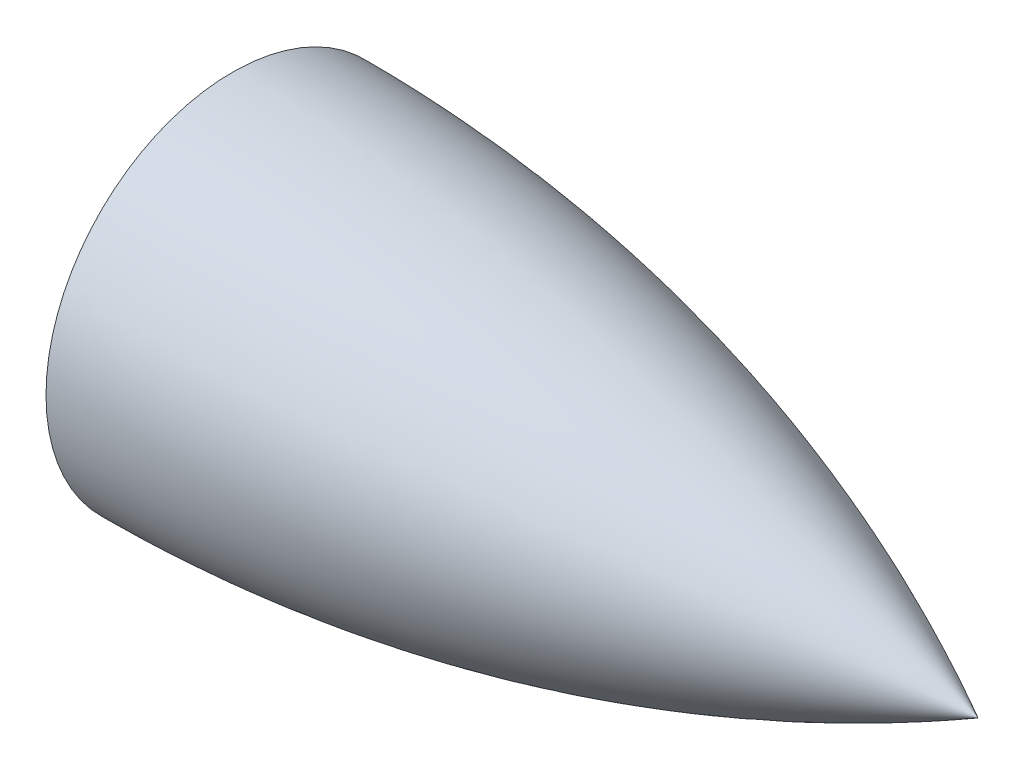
ISO-10303-21;
HEADER;
FILE_DESCRIPTION(('STEP AP214'),'2;1');
FILE_NAME('part.step','',(''),(''),'','','');
FILE_SCHEMA(('AUTOMOTIVE_DESIGN { 1 0 10303 214 1 1 1 1 }'));
ENDSEC;
DATA;
#1=APPLICATION_CONTEXT('core data for automotive mechanical design processes');
#2=APPLICATION_PROTOCOL_DEFINITION('international standard','automotive_design',2000,#1);
#3=PRODUCT_CONTEXT('',#1,'mechanical');
#4=PRODUCT('Part','Part','',(#3));
#5=PRODUCT_RELATED_PRODUCT_CATEGORY('part','',(#4));
#6=PRODUCT_DEFINITION_FORMATION('','',#4);
#7=PRODUCT_DEFINITION_CONTEXT('part definition',#1,'design');
#8=PRODUCT_DEFINITION('design','',#6,#7);
#9=PRODUCT_DEFINITION_SHAPE('','',#8);
#10=(LENGTH_UNIT() NAMED_UNIT(*) SI_UNIT(.MILLI.,.METRE.));
#11=(NAMED_UNIT(*) PLANE_ANGLE_UNIT() SI_UNIT($,.RADIAN.));
#12=(NAMED_UNIT(*) SI_UNIT($,.STERADIAN.) SOLID_ANGLE_UNIT());
#13=UNCERTAINTY_MEASURE_WITH_UNIT(LENGTH_MEASURE(1.E-05),#10,'distance_accuracy_value','');
#14=(GEOMETRIC_REPRESENTATION_CONTEXT(3) GLOBAL_UNCERTAINTY_ASSIGNED_CONTEXT((#13)) GLOBAL_UNIT_ASSIGNED_CONTEXT((#10,
#11,#12)) REPRESENTATION_CONTEXT('',''));
#15=CARTESIAN_POINT('',(0.,0.,0.));
#16=DIRECTION('',(0.,0.,1.));
#17=DIRECTION('',(1.,0.,0.));
#18=AXIS2_PLACEMENT_3D('',#15,#16,#17);
#19=CARTESIAN_POINT('',(0.,0.,0.));
#20=DIRECTION('',(1.,0.,0.));
#21=DIRECTION('',(0.,0.,-1.));
#22=AXIS2_PLACEMENT_3D('',#19,#20,#21);
#23=PLANE('',#22);
#24=CARTESIAN_POINT('',(0.,0.,0.));
#25=DIRECTION('',(-1.,0.,0.));
#26=DIRECTION('',(0.,0.,1.));
#27=AXIS2_PLACEMENT_3D('',#24,#25,#26);
#28=CIRCLE('',#27,76.2000000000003);
#29=CARTESIAN_POINT('',(0.,0.,76.2000000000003));
#30=VERTEX_POINT('',#29);
#31=EDGE_CURVE('E11',#30,#30,#28,.T.);
#32=ORIENTED_EDGE('',*,*,#31,.T.);
#33=EDGE_LOOP('',(#32));
#34=FACE_BOUND('',#33,.T.);
#35=ADVANCED_FACE('F36',(#34),#23,.F.);
#36=CARTESIAN_POINT('',(0.,0.,-571.499999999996));
#37=DIRECTION('',(0.,-1.,0.));
#38=DIRECTION('',(0.,0.,1.));
#39=AXIS2_PLACEMENT_3D('',#36,#37,#38);
#40=CIRCLE('',#39,647.699999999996);
#41=TRIMMED_CURVE('',#40,(PARAMETER_VALUE(-0.489957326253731)),
(PARAMETER_VALUE(0.489957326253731)),.T.,.PARAMETER.);
#42=CARTESIAN_POINT('',(0.,0.,0.));
#43=DIRECTION('',(-1.,0.,0.));
#44=AXIS1_PLACEMENT('',#42,#43);
#45=SURFACE_OF_REVOLUTION('',#41,#44);
#46=ORIENTED_EDGE('',*,*,#31,.F.);
#47=EDGE_LOOP('',(#46));
#48=FACE_BOUND('',#47,.T.);
#49=CARTESIAN_POINT('',(304.8,0.,0.));
#50=VERTEX_POINT('',#49);
#51=VERTEX_LOOP('',#50);
#52=FACE_BOUND('',#51,.T.);
#53=ADVANCED_FACE('F44',(#48,#52),#45,.T.);
#54=CLOSED_SHELL('',(#35,#53));
#55=MANIFOLD_SOLID_BREP('B2',#54);
#56=ADVANCED_BREP_SHAPE_REPRESENTATION('',(#18,#55),#14);
#57=SHAPE_DEFINITION_REPRESENTATION(#9,#56);
ENDSEC;
END-ISO-10303-21;
